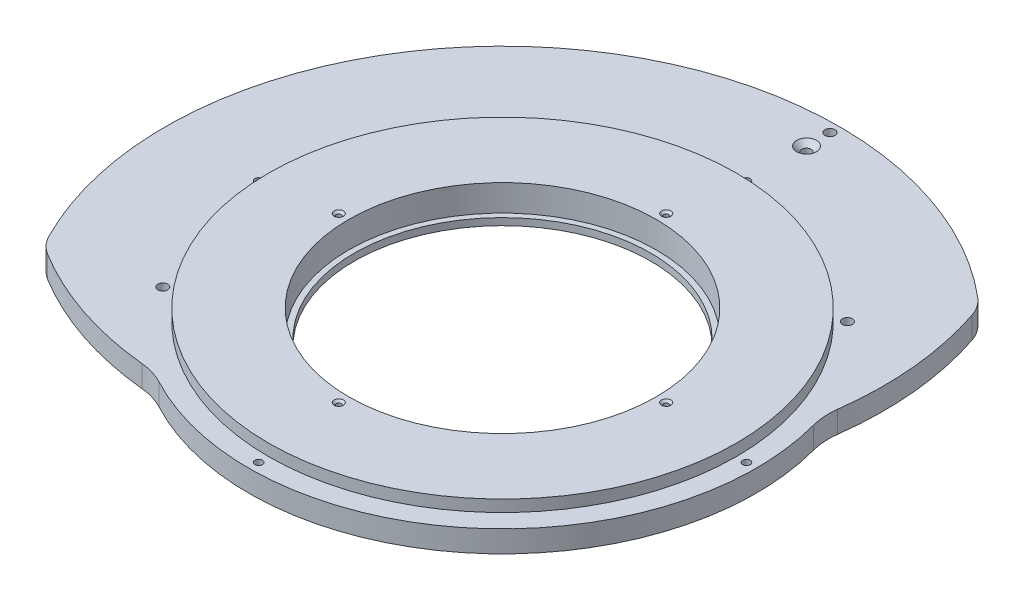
from build123d import *

# Parameters (mm, degrees)
BASE_EXTRUDE_DEPTH                                   = 15.875
SKETCH4_R                                            = 182.5625
SKETCH4_R_2                                          = 111.125
CUT_EXTRUDE1_DEPTH                                   = 5.55625
SKETCH6_R                                            = 73.03135
CUT_EXTRUDE2_DEPTH                                   = 12.5476
SKETCH7_R                                            = 70.4215
CUT_EXTRUDE3_DEPTH                                   = 228.026638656
HOLE9_D                                              = 4.365625
HOLE9_DEPTH                                          = 203.2
HOLE9_CBORE_D                                        = 4.7371
HOLE9_CBORE_DEPTH                                    = 14.2875
HOLE10_D                                             = 4.365625
HOLE10_DEPTH                                         = 203.2
HOLE10_CBORE_D                                       = 4.7371
HOLE10_CBORE_DEPTH                                   = 14.2875
CSK_FOR_M4_COUNTERSUNK_RAISED_HEAD_SCREW_D           = 4.5
CSK_FOR_M4_COUNTERSUNK_RAISED_HEAD_SCREW_CSINK_D     = 9.4
CSK_FOR_M4_COUNTERSUNK_RAISED_HEAD_SCREW_CSINK_ANGLE = 90
HOLE13_D                                             = 4.365625
HOLE13_DEPTH                                         = 14.2875
HOLE13_CBORE_D                                       = 4.7879
HOLE13_CBORE_DEPTH                                   = 7.14375
HOLE13_TIP                                           = 1.31156607
CIRPATTERN1_COUNT                                    = 4
CIRPATTERN2_COUNT                                    = 4


with BuildPart() as part:
    # Sketch3 → Base-Extrude (new body)
    with BuildSketch(Plane(origin=(0, 1203.325, 0), x_dir=(-1, 0, 0), z_dir=(0, 1, 0))):
        with BuildLine():
            ThreePointArc((-103.030304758, -122.786735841), (99.780816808, -125.441678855), (142.816495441, 72.768639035))
            ThreePointArc((142.816495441, 72.768639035), (139.834066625, 77.045863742), (135.801176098, 80.351211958))
            ThreePointArc((135.801176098, 80.351211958), (103.404398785, 95.447729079), (68.450892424, 102.911535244))
            ThreePointArc((68.450892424, 102.911535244), (62.359217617, 104.116723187), (56.617894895, 106.482773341))
            ThreePointArc((56.617894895, 106.482773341), (-75.074767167, 94.38191763), (-116.48988191, -31.213369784))
            ThreePointArc((-116.48988191, -31.213369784), (-115.475990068, -37.339788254), (-115.672019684, -43.546442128))
            ThreePointArc((-115.672019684, -43.546442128), (-116.262338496, -79.283083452), (-108.840433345, -114.245510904))
            ThreePointArc((-108.840433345, -114.245510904), (-106.527003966, -118.918580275), (-103.030304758, -122.786735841))
        make_face()
    extrude(amount=BASE_EXTRUDE_DEPTH)

    # Sketch4 → Cut-Extrude1 (cut)
    with BuildSketch(Plane(origin=(0, 1219.2, 0), x_dir=(-1, 0, 0), z_dir=(0, 1, 0))):
        Circle(SKETCH4_R)
        with Locations(Location((0, 0, 0), (0, 0, 90))):
            Circle(SKETCH4_R_2, mode=Mode.SUBTRACT)
    extrude(amount=-CUT_EXTRUDE1_DEPTH, mode=Mode.SUBTRACT)

    # Sketch6 → Cut-Extrude2 (cut)
    with BuildSketch(Plane(origin=(0, 1219.2, 0), x_dir=(-1, 0, 0), z_dir=(0, 1, 0))):
        with Locations(Location((0, 0, 0), (0, 0, 90))):
            Circle(SKETCH6_R)
    extrude(amount=-CUT_EXTRUDE2_DEPTH, mode=Mode.SUBTRACT)

    # Sketch7 → Cut-Extrude3 (cut, through all)
    with BuildSketch(Plane(origin=(0, 1206.6524, 0), x_dir=(-1, 0, 0), z_dir=(0, 1, 0))):
        with Locations(Location((0, 0, 0), (0, 0, 90))):
            Circle(SKETCH7_R)
    extrude(amount=-CUT_EXTRUDE3_DEPTH, mode=Mode.SUBTRACT)

    # Sketch10 → CSK for M2 Countersunk Raised Head Screw (revolve, cut)
    with BuildSketch(Plane(origin=(-77.7875, 1219.2, 0), x_dir=(0, 0, 1), z_dir=(1, 0, 0))):
        Polygon((0, 0), (0, 26.121032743), (1.2, 25.4), (1.2, 1), (2.2, 0), align=None)
    csk_for_m2_countersunk_raised_head_screw = revolve(axis=Axis((-77.7875, 1225.55, 0), (0, -1, 0)), mode=Mode.SUBTRACT)

    # Sketch19 → CSK for M1.6 Countersunk Flat Head Screw (revolve, cut)
    with BuildSketch(Plane(origin=(0, 1213.64375, 115.8875), x_dir=(0, 0, 1), z_dir=(1, 0, 0))):
        Polygon((0, 0), (0, 10.31875), (1, 10.31875), (1, 3.34), (1.8, 2.54), (1.8, 0), align=None)
    csk_for_m1_6_countersunk_flat_head_screw = revolve(axis=Axis((0, 1219.99375, 115.8875), (0, -1, 0)), mode=Mode.SUBTRACT)

    # Hole9
    with Locations(Plane(origin=(95.279391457, 1213.64375, -58.290093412), x_dir=(-1, 0, 0), z_dir=(0, 1, 0))):
        with Locations((13.334554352, -23.654743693)):
            CounterBoreHole(HOLE9_D / 2, HOLE9_CBORE_D / 2, HOLE9_CBORE_DEPTH, depth=HOLE9_DEPTH)

    # Hole10
    with Locations(Plane(origin=(-97.262405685, 1213.64375, 91.550407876), x_dir=(-1, 0, 0), z_dir=(0, 1, 0))):
        with Locations((-2.332923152, -25.080068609)):
            CounterBoreHole(HOLE10_D / 2, HOLE10_CBORE_D / 2, HOLE10_CBORE_DEPTH, depth=HOLE10_DEPTH)

    # CSK for M4 Countersunk Raised Head Screw (through all)
    with Locations(Plane(origin=(-7.506670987, 1213.64375, -118.718492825), x_dir=(-1, 0, 0), z_dir=(0, 1, 0))):
        with Locations((-7.506670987, -25.744007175)):
            CounterSinkHole(CSK_FOR_M4_COUNTERSUNK_RAISED_HEAD_SCREW_D / 2, CSK_FOR_M4_COUNTERSUNK_RAISED_HEAD_SCREW_CSINK_D / 2, counter_sink_angle=CSK_FOR_M4_COUNTERSUNK_RAISED_HEAD_SCREW_CSINK_ANGLE)

    # Hole13
    with Locations(Plane(origin=(-6.098933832, 1213.64375, -128.761451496), x_dir=(-1, 0, 0), z_dir=(0, 1, 0))):
        with Locations((-6.098933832, -26.813548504)):
            CounterBoreHole(HOLE13_D / 2, HOLE13_CBORE_D / 2, HOLE13_CBORE_DEPTH, depth=HOLE13_DEPTH)
            with Locations((0, 0, -(HOLE13_DEPTH + HOLE13_TIP / 2))):  # 118° drill point
                Cone(0, HOLE13_D / 2, HOLE13_TIP, mode=Mode.SUBTRACT)

    # CirPattern1: CSK for M2 Countersunk Raised Head Screw ×4 about axis
    cirpattern1_axis = Axis((0, 0, 0), (0, 1, 0))
    for i in range(1, CIRPATTERN1_COUNT):
        add(csk_for_m2_countersunk_raised_head_screw.rotate(cirpattern1_axis, i * 360 / CIRPATTERN1_COUNT), mode=Mode.SUBTRACT)

    # CirPattern2: CSK for M1.6 Countersunk Flat Head Screw ×4 about axis
    cirpattern2_axis = Axis((0, 0, 0), (0, 1, 0))
    for i in range(1, CIRPATTERN2_COUNT):
        add(csk_for_m1_6_countersunk_flat_head_screw.rotate(cirpattern2_axis, i * 360 / CIRPATTERN2_COUNT), mode=Mode.SUBTRACT)


solid = part.part
